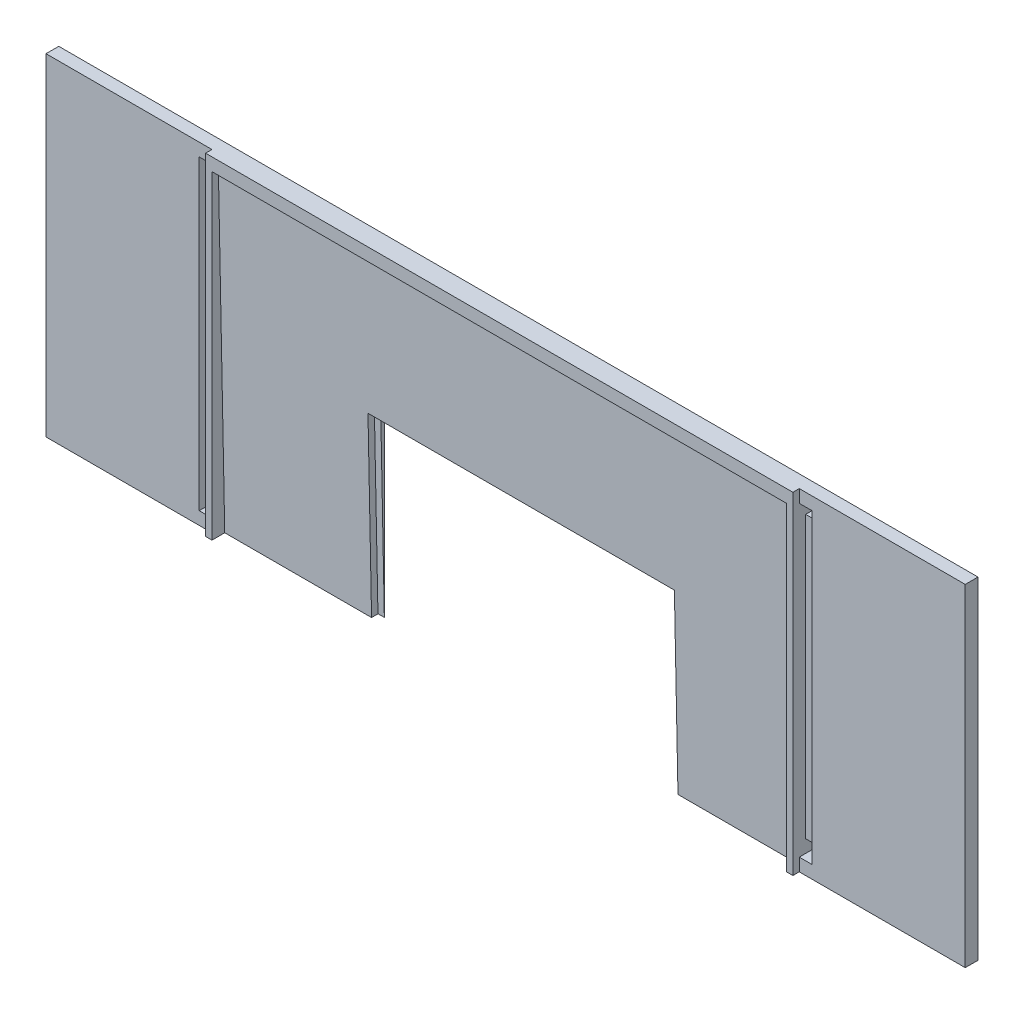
from build123d import *

# Parameters (mm, degrees)
BASE_DEPTH           = 25.4
SKETCH2_W            = 25.4
SKETCH2_H            = 609.6
HOOD_GROOVES_DEPTH   = 12.7
SPILL_GUARD_DEPTH    = 12.7
TILT_EXTRUSION_DEPTH = 1143
SKETCH8_W            = 25.4
SKETCH8_H            = 25.4
CUT_EXTRUDE3_DEPTH   = 12.7
BOSS_EXTRUDE1_REACH  = 974.831


with BuildPart() as part:
    # Sketch1 → Base (new body)
    with BuildSketch(Plane.XY):
        Polygon((330.2, -330.2), (914.4, -330.2), (914.4, 330.2), (-914.4, 330.2), (-914.4, -330.2), (-279.4, -330.2), (-279.4, 25.4), (330.2, 25.4), align=None)
    extrude(amount=-BASE_DEPTH)

    # Sketch2 → Hood Grooves (cut)
    with BuildSketch(Plane.XY):
        with Locations((-596.9, 0)):
            Rectangle(SKETCH2_W, SKETCH2_H)
        with Locations((596.9, 0)):
            Rectangle(SKETCH2_W, SKETCH2_H)
    extrude(amount=-HOOD_GROOVES_DEPTH, mode=Mode.SUBTRACT)

    # Sketch4 → Spill Guard (add)
    with BuildSketch(Plane.XY):
        Polygon((-584.2, 330.2), (584.2, 330.2), (584.2, -330.2), (571.5, -330.2), (571.5, 304.8), (-571.5, 304.8), (-571.5, -330.2), (-584.2, -330.2), align=None)
    extrude(amount=SPILL_GUARD_DEPTH)

    # Sketch5 → Tilt Extrusion (cut)
    with BuildSketch(Plane(origin=(-571.5, 0, 0), x_dir=(0, 0, -1), z_dir=(1, 0, 0))):
        Polygon((0, -330.2), (12.7, -330.2), (0, 304.8), align=None)
    extrude(amount=TILT_EXTRUSION_DEPTH, mode=Mode.SUBTRACT)

    # Sketch8 → Cut-Extrude3 (cut)
    with BuildSketch(Plane(origin=(0, 0, -25.4), x_dir=(-1, 0, 0), z_dir=(0, 0, -1))):
        with Locations((-596.9, 292.1)):
            Rectangle(SKETCH8_W, SKETCH8_H)
        with Locations((-596.9, -292.1)):
            Rectangle(SKETCH8_W, SKETCH8_H)
        with Locations((596.9, 292.1)):
            Rectangle(SKETCH8_W, SKETCH8_H)
        with Locations((596.9, -292.1)):
            Rectangle(SKETCH8_W, SKETCH8_H)
    extrude(amount=-CUT_EXTRUDE3_DEPTH, mode=Mode.SUBTRACT)

    # Boss-Extrude1: up to this plane
    boss_extrude1_end = Plane(origin=(0, 0, -25.4), z_dir=(0, 0, -1))
    # Sketch10 → Boss-Extrude1 (add, up to the surface)
    with BuildSketch(Plane(origin=(0, 0.375820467, -18.791023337), x_dir=(1, 0, 0), z_dir=(0, -0.01999600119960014, 0.9998000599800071)), mode=Mode.PRIVATE) as boss_extrude1_sk1:
        Polygon((317.5, -330.387929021), (330.2, -330.387929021), (330.2, 25.283183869), (-279.4, 25.283183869), (-279.4, -330.387929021), (-266.7, -330.387929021), (-266.7, 12.583183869), (317.5, 12.583183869), align=None)
    boss_extrude1_tool1 = split(extrude(boss_extrude1_sk1.sketch, amount=-BOSS_EXTRUDE1_REACH, mode=Mode.PRIVATE), bisect_by=boss_extrude1_end, keep=Keep.BOTH, mode=Mode.PRIVATE)
    add(boss_extrude1_tool1.solids().sort_by_distance((323.85, -322.889742, -25.256335))[0])


solid = part.part
